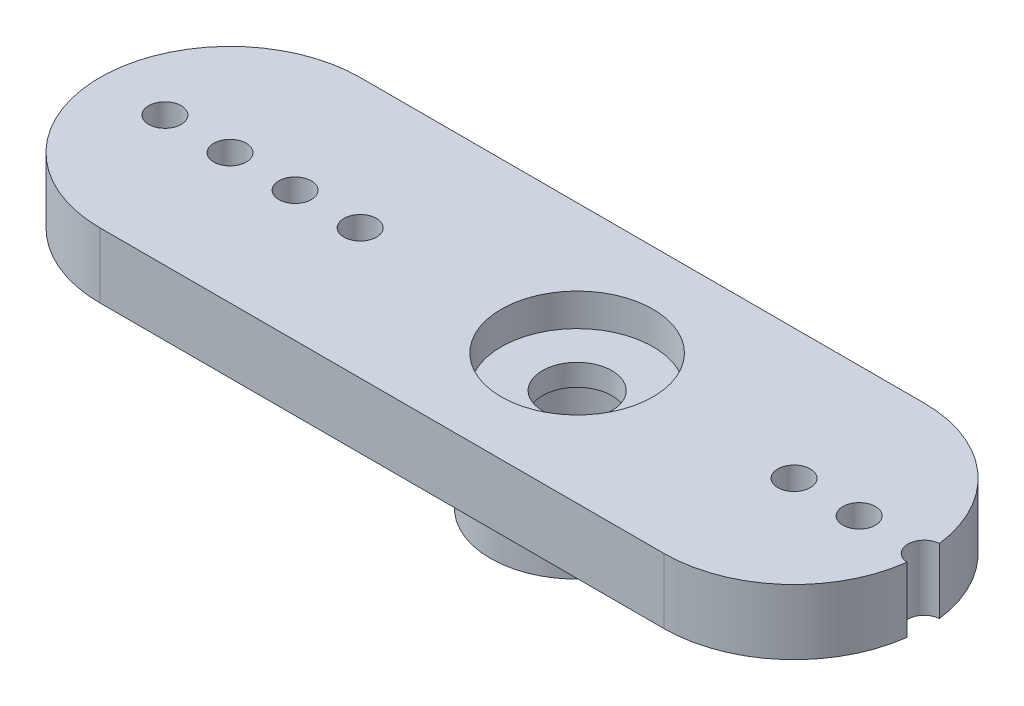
from build123d import *

# Parameters (mm, degrees)
BOSS_EXTRU_1_DEPTH      = 3
ESQUISSE2_R             = 0.75
ENL_V_MAT_EXTRU_1_DEPTH = 24
ESQUISSE3_R             = 4
BOSS_EXTRU_2_DEPTH      = 3.2
ESQUISSE4_R             = 2.75
ENL_V_MAT_EXTRU_2_DEPTH = 3.7
ESQUISSE5_R             = 3.5
ENL_V_MAT_EXTRU_3_DEPTH = 1.5
ESQUISSE6_R             = 1.6
ENL_V_MAT_EXTRU_4_DEPTH = 24.282826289
ENL_V_MAT_EXTRU_5_DEPTH = 24.631335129


with BuildPart() as part:
    # Esquisse1 → Boss.-Extru.1 (new body)
    with BuildSketch(Plane(origin=(0, 0, 0), x_dir=(1, 0, 0), z_dir=(0, 1, 0))):
        with BuildLine():
            Line((-16, 6), (16, 6))
            ThreePointArc((16, 6), (22, 0), (16, -6))
            Line((16, -6), (-16, -6))
            ThreePointArc((-16, -6), (-22, 0), (-16, 6))
        make_face()
    extrude(amount=BOSS_EXTRU_1_DEPTH)

    # Esquisse2 → Enl_v. mat.-Extru.1 (cut, through all)
    with BuildSketch(Plane(origin=(0, 3, 0), x_dir=(1, 0, 0), z_dir=(0, 1, 0))):
        with Locations(Location((-19, 0, 0), (0, 0, 270))):
            Circle(ESQUISSE2_R)
        with Locations(Location((-16, 0, 0), (0, 0, 270))):
            Circle(ESQUISSE2_R)
        with Locations(Location((-13, 0, 0), (0, 0, 270))):
            Circle(ESQUISSE2_R)
        with Locations(Location((-10, 0, 0), (0, 0, 270))):
            Circle(ESQUISSE2_R)
        with Locations(Location((10, 0, 0), (0, 0, 270))):
            Circle(ESQUISSE2_R)
        with Locations(Location((13, 0, 0), (0, 0, 270))):
            Circle(ESQUISSE2_R)
        with Locations(Location((16, 0, 0), (0, 0, 270))):
            Circle(ESQUISSE2_R)
        with Locations(Location((19, 0, 0), (0, 0, 270))):
            Circle(ESQUISSE2_R)
    extrude(amount=-ENL_V_MAT_EXTRU_1_DEPTH, mode=Mode.SUBTRACT)

    # Esquisse3 → Boss.-Extru.2 (add)
    with BuildSketch(Plane.XZ):
        with Locations(Location((0, 0, 0), (0, 0, 90))):
            Circle(ESQUISSE3_R)
    extrude(amount=BOSS_EXTRU_2_DEPTH)

    # Esquisse4 → Enl_v. mat.-Extru.2 (cut)
    with BuildSketch(Plane.XZ.offset(3.2)):
        with Locations(Location((0, 0, 0), (0, 0, 270))):
            Circle(ESQUISSE4_R)
    extrude(amount=-ENL_V_MAT_EXTRU_2_DEPTH, mode=Mode.SUBTRACT)

    # Esquisse5 → Enl_v. mat.-Extru.3 (cut)
    with BuildSketch(Plane(origin=(0, 3, 0), x_dir=(1, 0, 0), z_dir=(0, 1, 0))):
        with Locations(Location((0, 0, 0), (0, 0, 270))):
            Circle(ESQUISSE5_R)
    extrude(amount=-ENL_V_MAT_EXTRU_3_DEPTH, mode=Mode.SUBTRACT)

    # Esquisse6 → Enl_v. mat.-Extru.4 (cut, through all)
    with BuildSketch(Plane(origin=(0, 1.5, 0), x_dir=(1, 0, 0), z_dir=(0, 1, 0))):
        with Locations(Location((0, 0, 0), (0, 0, 270))):
            Circle(ESQUISSE6_R)
    extrude(amount=-ENL_V_MAT_EXTRU_4_DEPTH, mode=Mode.SUBTRACT)

    # Esquisse7 → Enl_v. mat.-Extru.5 (cut, through all)
    with BuildSketch(Plane(origin=(0, 3, 0), x_dir=(1, 0, 0), z_dir=(0, 1, 0))):
        with BuildLine():
            Line((10, -6), (16, -6))
            ThreePointArc((16, -6), (22, 0), (16, 6))
            Line((16, 6), (10, 6))
            ThreePointArc((10, 6), (16, 0), (10, -6))
        make_face()
    extrude(amount=-ENL_V_MAT_EXTRU_5_DEPTH, mode=Mode.SUBTRACT)


solid = part.part
